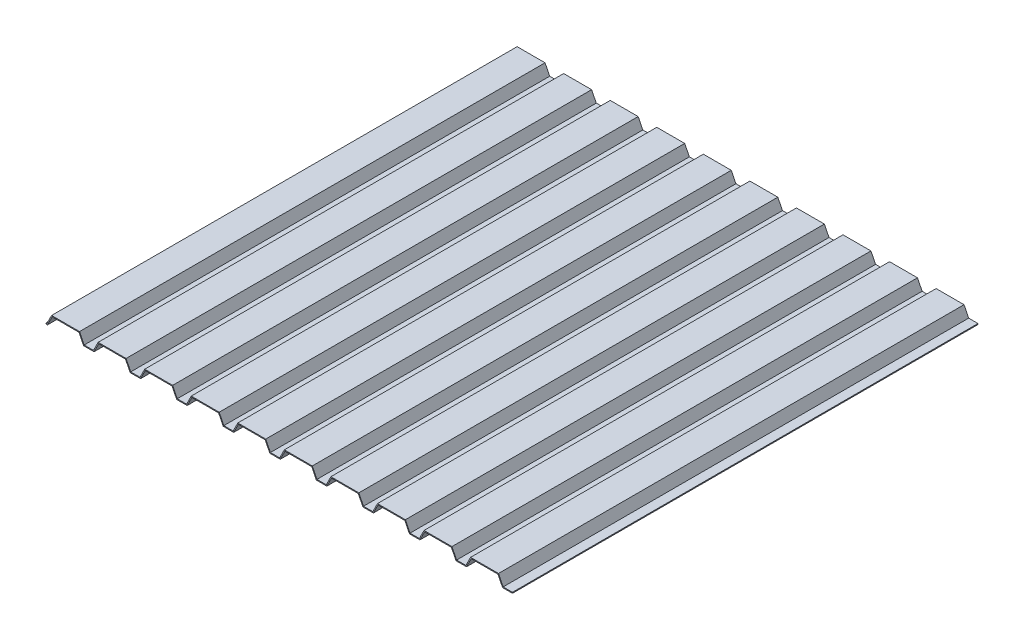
from build123d import *

# Parameters (mm, degrees)
LINEAR_AUSTRAGEN_D_NN1_DEPTH = 500
LINEARES_MUSTER2_COUNT       = 10
LINEARES_MUSTER2_PITCH       = 50


with BuildPart() as part:
    # Skizze1 → Linear-Austragen-D_nn1 (new body)
    with BuildSketch(Plane.XY):
        Polygon((-1, 0), (0, 0), (5, 10), (35, 10), (40, 0), (50, 0), (50, -1), (39.381966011, -1), (34.381966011, 9), (5.618033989, 9), (0.618033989, -1), (-1, -1), align=None)
    linear_austragen_d_nn1 = extrude(amount=LINEAR_AUSTRAGEN_D_NN1_DEPTH)

    # Lineares Muster2: Linear-Austragen-D_nn1 ×10
    with Locations(*[(-i * LINEARES_MUSTER2_PITCH, 0, 0) for i in range(1, LINEARES_MUSTER2_COUNT)]):
        add(linear_austragen_d_nn1)


solid = part.part
